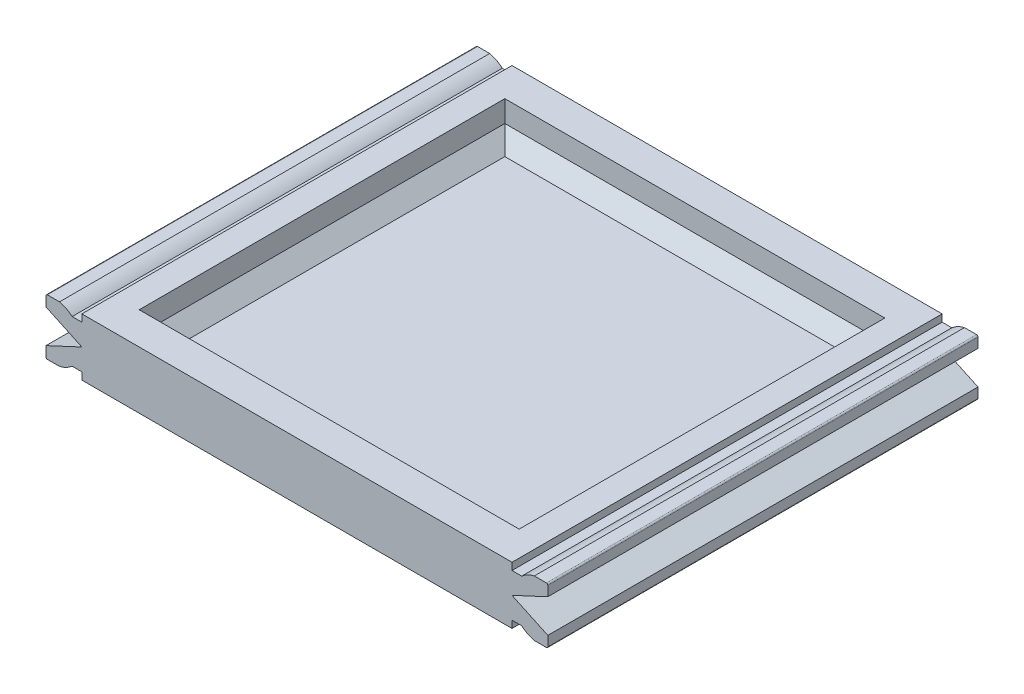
ISO-10303-21;
HEADER;
FILE_DESCRIPTION(('STEP AP214'),'2;1');
FILE_NAME('part.step','',(''),(''),'','','');
FILE_SCHEMA(('AUTOMOTIVE_DESIGN { 1 0 10303 214 1 1 1 1 }'));
ENDSEC;
DATA;
#1=APPLICATION_CONTEXT('core data for automotive mechanical design processes');
#2=APPLICATION_PROTOCOL_DEFINITION('international standard','automotive_design',2000,#1);
#3=PRODUCT_CONTEXT('',#1,'mechanical');
#4=PRODUCT('Part','Part','',(#3));
#5=PRODUCT_RELATED_PRODUCT_CATEGORY('part','',(#4));
#6=PRODUCT_DEFINITION_FORMATION('','',#4);
#7=PRODUCT_DEFINITION_CONTEXT('part definition',#1,'design');
#8=PRODUCT_DEFINITION('design','',#6,#7);
#9=PRODUCT_DEFINITION_SHAPE('','',#8);
#10=(LENGTH_UNIT() NAMED_UNIT(*) SI_UNIT(.MILLI.,.METRE.));
#11=(NAMED_UNIT(*) PLANE_ANGLE_UNIT() SI_UNIT($,.RADIAN.));
#12=(NAMED_UNIT(*) SI_UNIT($,.STERADIAN.) SOLID_ANGLE_UNIT());
#13=UNCERTAINTY_MEASURE_WITH_UNIT(LENGTH_MEASURE(1.E-05),#10,'distance_accuracy_value','');
#14=(GEOMETRIC_REPRESENTATION_CONTEXT(3) GLOBAL_UNCERTAINTY_ASSIGNED_CONTEXT((#13)) GLOBAL_UNIT_ASSIGNED_CONTEXT((#10,
#11,#12)) REPRESENTATION_CONTEXT('',''));
#15=CARTESIAN_POINT('',(0.,0.,0.));
#16=DIRECTION('',(0.,0.,1.));
#17=DIRECTION('',(1.,0.,0.));
#18=AXIS2_PLACEMENT_3D('',#15,#16,#17);
#19=CARTESIAN_POINT('',(-15.,-2.,-15.));
#20=DIRECTION('',(-1.,0.,0.));
#21=DIRECTION('',(0.,0.,1.));
#22=AXIS2_PLACEMENT_3D('',#19,#20,#21);
#23=PLANE('',#22);
#24=DIRECTION('',(0.,1.,0.));
#25=VECTOR('',#24,1.);
#26=CARTESIAN_POINT('',(-15.,-2.,15.));
#27=LINE('',#26,#25);
#28=CARTESIAN_POINT('',(-15.,-2.,15.));
#29=VERTEX_POINT('',#28);
#30=CARTESIAN_POINT('',(-15.,-1.5,15.));
#31=VERTEX_POINT('',#30);
#32=EDGE_CURVE('E518',#29,#31,#27,.T.);
#33=ORIENTED_EDGE('',*,*,#32,.T.);
#34=DIRECTION('',(0.,0.,1.));
#35=VECTOR('',#34,1.);
#36=CARTESIAN_POINT('',(-15.,-1.5,-15.));
#37=LINE('',#36,#35);
#38=CARTESIAN_POINT('',(-15.,-1.5,-15.));
#39=VERTEX_POINT('',#38);
#40=EDGE_CURVE('E314',#39,#31,#37,.T.);
#41=ORIENTED_EDGE('',*,*,#40,.F.);
#42=DIRECTION('',(0.,1.,0.));
#43=VECTOR('',#42,1.);
#44=CARTESIAN_POINT('',(-15.,-2.,-15.));
#45=LINE('',#44,#43);
#46=CARTESIAN_POINT('',(-15.,-2.,-15.));
#47=VERTEX_POINT('',#46);
#48=EDGE_CURVE('E537',#47,#39,#45,.T.);
#49=ORIENTED_EDGE('',*,*,#48,.F.);
#50=DIRECTION('',(0.,0.,1.));
#51=VECTOR('',#50,1.);
#52=CARTESIAN_POINT('',(-15.,-2.,-15.));
#53=LINE('',#52,#51);
#54=EDGE_CURVE('E549',#47,#29,#53,.T.);
#55=ORIENTED_EDGE('',*,*,#54,.T.);
#56=EDGE_LOOP('',(#33,#41,#49,#55));
#57=FACE_BOUND('',#56,.T.);
#58=ADVANCED_FACE('F36',(#57),#23,.T.);
#59=CARTESIAN_POINT('',(-15.,1.5,-15.));
#60=VERTEX_POINT('',#59);
#61=CARTESIAN_POINT('',(-15.,2.,-15.));
#62=VERTEX_POINT('',#61);
#63=EDGE_CURVE('E536',#60,#62,#45,.T.);
#64=ORIENTED_EDGE('',*,*,#63,.F.);
#65=DIRECTION('',(0.,0.,1.));
#66=VECTOR('',#65,1.);
#67=CARTESIAN_POINT('',(-15.,1.5,-15.));
#68=LINE('',#67,#66);
#69=CARTESIAN_POINT('',(-15.,1.5,15.));
#70=VERTEX_POINT('',#69);
#71=EDGE_CURVE('E342',#60,#70,#68,.T.);
#72=ORIENTED_EDGE('',*,*,#71,.T.);
#73=CARTESIAN_POINT('',(-15.,2.,15.));
#74=VERTEX_POINT('',#73);
#75=EDGE_CURVE('E523',#70,#74,#27,.T.);
#76=ORIENTED_EDGE('',*,*,#75,.T.);
#77=DIRECTION('',(0.,0.,1.));
#78=VECTOR('',#77,1.);
#79=CARTESIAN_POINT('',(-15.,2.,-15.));
#80=LINE('',#79,#78);
#81=EDGE_CURVE('E639',#62,#74,#80,.T.);
#82=ORIENTED_EDGE('',*,*,#81,.F.);
#83=EDGE_LOOP('',(#64,#72,#76,#82));
#84=FACE_BOUND('',#83,.T.);
#85=ADVANCED_FACE('F734',(#84),#23,.T.);
#86=CARTESIAN_POINT('',(15.,-2.,-15.));
#87=DIRECTION('',(1.,0.,0.));
#88=DIRECTION('',(0.,0.,-1.));
#89=AXIS2_PLACEMENT_3D('',#86,#87,#88);
#90=PLANE('',#89);
#91=DIRECTION('',(0.,0.,1.));
#92=VECTOR('',#91,1.);
#93=CARTESIAN_POINT('',(15.,-1.5,-15.));
#94=LINE('',#93,#92);
#95=CARTESIAN_POINT('',(15.,-1.5,-15.));
#96=VERTEX_POINT('',#95);
#97=CARTESIAN_POINT('',(15.,-1.5,15.));
#98=VERTEX_POINT('',#97);
#99=EDGE_CURVE('E466',#96,#98,#94,.T.);
#100=ORIENTED_EDGE('',*,*,#99,.T.);
#101=DIRECTION('',(0.,1.,0.));
#102=VECTOR('',#101,1.);
#103=CARTESIAN_POINT('',(15.,-2.,15.));
#104=LINE('',#103,#102);
#105=CARTESIAN_POINT('',(15.,-2.,15.));
#106=VERTEX_POINT('',#105);
#107=EDGE_CURVE('E666',#106,#98,#104,.T.);
#108=ORIENTED_EDGE('',*,*,#107,.F.);
#109=DIRECTION('',(0.,0.,-1.));
#110=VECTOR('',#109,1.);
#111=CARTESIAN_POINT('',(15.,-2.,-15.));
#112=LINE('',#111,#110);
#113=CARTESIAN_POINT('',(15.,-2.,-15.));
#114=VERTEX_POINT('',#113);
#115=EDGE_CURVE('E540',#106,#114,#112,.T.);
#116=ORIENTED_EDGE('',*,*,#115,.T.);
#117=DIRECTION('',(0.,1.,0.));
#118=VECTOR('',#117,1.);
#119=CARTESIAN_POINT('',(15.,-2.,-15.));
#120=LINE('',#119,#118);
#121=EDGE_CURVE('E558',#114,#96,#120,.T.);
#122=ORIENTED_EDGE('',*,*,#121,.T.);
#123=EDGE_LOOP('',(#100,#108,#116,#122));
#124=FACE_BOUND('',#123,.T.);
#125=ADVANCED_FACE('F659',(#124),#90,.T.);
#126=CARTESIAN_POINT('',(15.,-2.,-15.));
#127=DIRECTION('',(0.,0.,-1.));
#128=DIRECTION('',(-1.,0.,0.));
#129=AXIS2_PLACEMENT_3D('',#126,#127,#128);
#130=PLANE('',#129);
#131=DIRECTION('',(0.,-1.,0.));
#132=VECTOR('',#131,1.);
#133=CARTESIAN_POINT('',(17.5,0.,-15.));
#134=LINE('',#133,#132);
#135=CARTESIAN_POINT('',(17.5,-1.1657691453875,-15.));
#136=VERTEX_POINT('',#135);
#137=CARTESIAN_POINT('',(17.5,-1.85,-15.));
#138=VERTEX_POINT('',#137);
#139=EDGE_CURVE('E451',#136,#138,#134,.T.);
#140=ORIENTED_EDGE('',*,*,#139,.T.);
#141=CARTESIAN_POINT('',(17.4,-1.85,-15.));
#142=DIRECTION('',(0.,0.,-1.));
#143=DIRECTION('',(-1.,0.,0.));
#144=AXIS2_PLACEMENT_3D('',#141,#142,#143);
#145=CIRCLE('',#144,0.1);
#146=CARTESIAN_POINT('',(17.4,-1.95,-15.));
#147=VERTEX_POINT('',#146);
#148=EDGE_CURVE('E387',#138,#147,#145,.T.);
#149=ORIENTED_EDGE('',*,*,#148,.T.);
#150=DIRECTION('',(-1.,0.,0.));
#151=VECTOR('',#150,1.);
#152=CARTESIAN_POINT('',(0.,-1.94999999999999,-15.));
#153=LINE('',#152,#151);
#154=CARTESIAN_POINT('',(16.5555902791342,-1.95,-15.));
#155=VERTEX_POINT('',#154);
#156=EDGE_CURVE('E449',#147,#155,#153,.T.);
#157=ORIENTED_EDGE('',*,*,#156,.T.);
#158=CARTESIAN_POINT('',(17.,0.,-15.));
#159=DIRECTION('',(0.,0.,-1.));
#160=DIRECTION('',(1.,0.,0.));
#161=AXIS2_PLACEMENT_3D('',#158,#159,#160);
#162=CIRCLE('',#161,2.);
#163=CARTESIAN_POINT('',(15.6771243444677,-1.5,-15.));
#164=VERTEX_POINT('',#163);
#165=EDGE_CURVE('E457',#155,#164,#162,.T.);
#166=ORIENTED_EDGE('',*,*,#165,.T.);
#167=DIRECTION('',(1.,0.,0.));
#168=VECTOR('',#167,1.);
#169=CARTESIAN_POINT('',(0.,-1.50000000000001,-15.));
#170=LINE('',#169,#168);
#171=EDGE_CURVE('E454',#96,#164,#170,.T.);
#172=ORIENTED_EDGE('',*,*,#171,.F.);
#173=ORIENTED_EDGE('',*,*,#121,.F.);
#174=DIRECTION('',(-1.,0.,0.));
#175=VECTOR('',#174,1.);
#176=CARTESIAN_POINT('',(15.,-2.,-15.));
#177=LINE('',#176,#175);
#178=EDGE_CURVE('E648',#114,#47,#177,.T.);
#179=ORIENTED_EDGE('',*,*,#178,.T.);
#180=ORIENTED_EDGE('',*,*,#48,.T.);
#181=DIRECTION('',(-1.,0.,0.));
#182=VECTOR('',#181,1.);
#183=CARTESIAN_POINT('',(0.,-1.50000000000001,-15.));
#184=LINE('',#183,#182);
#185=CARTESIAN_POINT('',(-15.6771243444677,-1.5,-15.));
#186=VERTEX_POINT('',#185);
#187=EDGE_CURVE('E306',#39,#186,#184,.T.);
#188=ORIENTED_EDGE('',*,*,#187,.T.);
#189=CARTESIAN_POINT('',(-17.,0.,-15.));
#190=DIRECTION('',(0.,0.,1.));
#191=DIRECTION('',(-1.,0.,0.));
#192=AXIS2_PLACEMENT_3D('',#189,#190,#191);
#193=CIRCLE('',#192,2.);
#194=CARTESIAN_POINT('',(-16.5555902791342,-1.95,-15.));
#195=VERTEX_POINT('',#194);
#196=EDGE_CURVE('E304',#195,#186,#193,.T.);
#197=ORIENTED_EDGE('',*,*,#196,.F.);
#198=DIRECTION('',(1.,0.,0.));
#199=VECTOR('',#198,1.);
#200=CARTESIAN_POINT('',(0.,-1.94999999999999,-15.));
#201=LINE('',#200,#199);
#202=CARTESIAN_POINT('',(-17.4,-1.95,-15.));
#203=VERTEX_POINT('',#202);
#204=EDGE_CURVE('E287',#203,#195,#201,.T.);
#205=ORIENTED_EDGE('',*,*,#204,.F.);
#206=CARTESIAN_POINT('',(-17.4,-1.85,-15.));
#207=DIRECTION('',(0.,0.,-1.));
#208=DIRECTION('',(-1.,0.,0.));
#209=AXIS2_PLACEMENT_3D('',#206,#207,#208);
#210=CIRCLE('',#209,0.1);
#211=CARTESIAN_POINT('',(-17.5,-1.85,-15.));
#212=VERTEX_POINT('',#211);
#213=EDGE_CURVE('E384',#203,#212,#210,.T.);
#214=ORIENTED_EDGE('',*,*,#213,.T.);
#215=DIRECTION('',(0.,-1.,0.));
#216=VECTOR('',#215,1.);
#217=CARTESIAN_POINT('',(-17.5,0.,-15.));
#218=LINE('',#217,#216);
#219=CARTESIAN_POINT('',(-17.5,-1.1657691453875,-15.));
#220=VERTEX_POINT('',#219);
#221=EDGE_CURVE('E292',#220,#212,#218,.T.);
#222=ORIENTED_EDGE('',*,*,#221,.F.);
#223=DIRECTION('',(-0.906307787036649,-0.422618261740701,0.));
#224=VECTOR('',#223,1.);
#225=CARTESIAN_POINT('',(-2.67909292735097,5.74533332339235,-15.));
#226=LINE('',#225,#224);
#227=CARTESIAN_POINT('',(-15.,0.,-15.));
#228=VERTEX_POINT('',#227);
#229=EDGE_CURVE('E308',#228,#220,#226,.T.);
#230=ORIENTED_EDGE('',*,*,#229,.F.);
#231=DIRECTION('',(-0.906307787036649,0.422618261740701,0.));
#232=VECTOR('',#231,1.);
#233=CARTESIAN_POINT('',(-2.67909292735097,-5.74533332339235,-15.));
#234=LINE('',#233,#232);
#235=CARTESIAN_POINT('',(-17.5,1.1657691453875,-15.));
#236=VERTEX_POINT('',#235);
#237=EDGE_CURVE('E331',#228,#236,#234,.T.);
#238=ORIENTED_EDGE('',*,*,#237,.T.);
#239=DIRECTION('',(0.,1.,0.));
#240=VECTOR('',#239,1.);
#241=CARTESIAN_POINT('',(-17.5,0.,-15.));
#242=LINE('',#241,#240);
#243=CARTESIAN_POINT('',(-17.5,1.85,-15.));
#244=VERTEX_POINT('',#243);
#245=EDGE_CURVE('E328',#236,#244,#242,.T.);
#246=ORIENTED_EDGE('',*,*,#245,.T.);
#247=CARTESIAN_POINT('',(-17.4,1.85,-15.));
#248=DIRECTION('',(0.,0.,-1.));
#249=DIRECTION('',(-1.,0.,0.));
#250=AXIS2_PLACEMENT_3D('',#247,#248,#249);
#251=CIRCLE('',#250,0.1);
#252=CARTESIAN_POINT('',(-17.4,1.95,-15.));
#253=VERTEX_POINT('',#252);
#254=EDGE_CURVE('E382',#244,#253,#251,.T.);
#255=ORIENTED_EDGE('',*,*,#254,.T.);
#256=DIRECTION('',(1.,0.,0.));
#257=VECTOR('',#256,1.);
#258=CARTESIAN_POINT('',(0.,1.94999999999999,-15.));
#259=LINE('',#258,#257);
#260=CARTESIAN_POINT('',(-16.5555902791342,1.95,-15.));
#261=VERTEX_POINT('',#260);
#262=EDGE_CURVE('E325',#253,#261,#259,.T.);
#263=ORIENTED_EDGE('',*,*,#262,.T.);
#264=CARTESIAN_POINT('',(-17.,0.,-15.));
#265=DIRECTION('',(0.,0.,-1.));
#266=DIRECTION('',(-1.,0.,0.));
#267=AXIS2_PLACEMENT_3D('',#264,#265,#266);
#268=CIRCLE('',#267,2.);
#269=CARTESIAN_POINT('',(-15.6771243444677,1.5,-15.));
#270=VERTEX_POINT('',#269);
#271=EDGE_CURVE('E332',#261,#270,#268,.T.);
#272=ORIENTED_EDGE('',*,*,#271,.T.);
#273=DIRECTION('',(-1.,0.,0.));
#274=VECTOR('',#273,1.);
#275=CARTESIAN_POINT('',(0.,1.50000000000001,-15.));
#276=LINE('',#275,#274);
#277=EDGE_CURVE('E335',#60,#270,#276,.T.);
#278=ORIENTED_EDGE('',*,*,#277,.F.);
#279=ORIENTED_EDGE('',*,*,#63,.T.);
#280=DIRECTION('',(-1.,0.,0.));
#281=VECTOR('',#280,1.);
#282=CARTESIAN_POINT('',(15.,2.,-15.));
#283=LINE('',#282,#281);
#284=CARTESIAN_POINT('',(15.,2.,-15.));
#285=VERTEX_POINT('',#284);
#286=EDGE_CURVE('E613',#285,#62,#283,.T.);
#287=ORIENTED_EDGE('',*,*,#286,.F.);
#288=CARTESIAN_POINT('',(15.,1.5,-15.));
#289=VERTEX_POINT('',#288);
#290=EDGE_CURVE('E555',#289,#285,#120,.T.);
#291=ORIENTED_EDGE('',*,*,#290,.F.);
#292=DIRECTION('',(1.,0.,0.));
#293=VECTOR('',#292,1.);
#294=CARTESIAN_POINT('',(0.,1.50000000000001,-15.));
#295=LINE('',#294,#293);
#296=CARTESIAN_POINT('',(15.6771243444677,1.5,-15.));
#297=VERTEX_POINT('',#296);
#298=EDGE_CURVE('E483',#289,#297,#295,.T.);
#299=ORIENTED_EDGE('',*,*,#298,.T.);
#300=CARTESIAN_POINT('',(17.,0.,-15.));
#301=DIRECTION('',(0.,0.,1.));
#302=DIRECTION('',(1.,0.,0.));
#303=AXIS2_PLACEMENT_3D('',#300,#301,#302);
#304=CIRCLE('',#303,2.);
#305=CARTESIAN_POINT('',(16.5555902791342,1.95,-15.));
#306=VERTEX_POINT('',#305);
#307=EDGE_CURVE('E480',#306,#297,#304,.T.);
#308=ORIENTED_EDGE('',*,*,#307,.F.);
#309=DIRECTION('',(-1.,0.,0.));
#310=VECTOR('',#309,1.);
#311=CARTESIAN_POINT('',(0.,1.94999999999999,-15.));
#312=LINE('',#311,#310);
#313=CARTESIAN_POINT('',(17.4,1.95,-15.));
#314=VERTEX_POINT('',#313);
#315=EDGE_CURVE('E477',#314,#306,#312,.T.);
#316=ORIENTED_EDGE('',*,*,#315,.F.);
#317=CARTESIAN_POINT('',(17.4,1.85,-15.));
#318=DIRECTION('',(0.,0.,-1.));
#319=DIRECTION('',(-1.,0.,0.));
#320=AXIS2_PLACEMENT_3D('',#317,#318,#319);
#321=CIRCLE('',#320,0.1);
#322=CARTESIAN_POINT('',(17.5,1.85,-15.));
#323=VERTEX_POINT('',#322);
#324=EDGE_CURVE('E51',#314,#323,#321,.T.);
#325=ORIENTED_EDGE('',*,*,#324,.T.);
#326=DIRECTION('',(0.,1.,0.));
#327=VECTOR('',#326,1.);
#328=CARTESIAN_POINT('',(17.5,0.,-15.));
#329=LINE('',#328,#327);
#330=CARTESIAN_POINT('',(17.5,1.1657691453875,-15.));
#331=VERTEX_POINT('',#330);
#332=EDGE_CURVE('E484',#331,#323,#329,.T.);
#333=ORIENTED_EDGE('',*,*,#332,.F.);
#334=DIRECTION('',(0.906307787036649,0.422618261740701,0.));
#335=VECTOR('',#334,1.);
#336=CARTESIAN_POINT('',(2.67909292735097,-5.74533332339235,-15.));
#337=LINE('',#336,#335);
#338=CARTESIAN_POINT('',(15.,0.,-15.));
#339=VERTEX_POINT('',#338);
#340=EDGE_CURVE('E487',#339,#331,#337,.T.);
#341=ORIENTED_EDGE('',*,*,#340,.F.);
#342=DIRECTION('',(0.906307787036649,-0.422618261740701,0.));
#343=VECTOR('',#342,1.);
#344=CARTESIAN_POINT('',(2.67909292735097,5.74533332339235,-15.));
#345=LINE('',#344,#343);
#346=EDGE_CURVE('E453',#339,#136,#345,.T.);
#347=ORIENTED_EDGE('',*,*,#346,.T.);
#348=EDGE_LOOP('',(#140,#149,#157,#166,#172,#173,#179,#180,#188,#197,#205,#214,#222,#230,#238,
#246,#255,#263,#272,#278,#279,#287,#291,#299,#308,#316,#325,#333,#341,#347));
#349=FACE_BOUND('',#348,.T.);
#350=ADVANCED_FACE('F416',(#349),#130,.T.);
#351=DIRECTION('',(0.,0.,1.));
#352=VECTOR('',#351,1.);
#353=CARTESIAN_POINT('',(15.,1.5,-15.));
#354=LINE('',#353,#352);
#355=CARTESIAN_POINT('',(15.,1.5,15.));
#356=VERTEX_POINT('',#355);
#357=EDGE_CURVE('E500',#289,#356,#354,.T.);
#358=ORIENTED_EDGE('',*,*,#357,.F.);
#359=ORIENTED_EDGE('',*,*,#290,.T.);
#360=DIRECTION('',(0.,0.,-1.));
#361=VECTOR('',#360,1.);
#362=CARTESIAN_POINT('',(15.,2.,-15.));
#363=LINE('',#362,#361);
#364=CARTESIAN_POINT('',(15.,2.,15.));
#365=VERTEX_POINT('',#364);
#366=EDGE_CURVE('E645',#365,#285,#363,.T.);
#367=ORIENTED_EDGE('',*,*,#366,.F.);
#368=EDGE_CURVE('E522',#356,#365,#104,.T.);
#369=ORIENTED_EDGE('',*,*,#368,.F.);
#370=EDGE_LOOP('',(#358,#359,#367,#369));
#371=FACE_BOUND('',#370,.T.);
#372=ADVANCED_FACE('F723',(#371),#90,.T.);
#373=CARTESIAN_POINT('',(15.,-2.,15.));
#374=DIRECTION('',(0.,0.,1.));
#375=DIRECTION('',(1.,0.,0.));
#376=AXIS2_PLACEMENT_3D('',#373,#374,#375);
#377=PLANE('',#376);
#378=DIRECTION('',(-1.,0.,0.));
#379=VECTOR('',#378,1.);
#380=CARTESIAN_POINT('',(0.,-1.94999999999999,15.));
#381=LINE('',#380,#379);
#382=CARTESIAN_POINT('',(17.4,-1.95,15.));
#383=VERTEX_POINT('',#382);
#384=CARTESIAN_POINT('',(16.5555902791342,-1.95,15.));
#385=VERTEX_POINT('',#384);
#386=EDGE_CURVE('E339',#383,#385,#381,.T.);
#387=ORIENTED_EDGE('',*,*,#386,.F.);
#388=CARTESIAN_POINT('',(17.4,-1.85,15.));
#389=DIRECTION('',(0.,0.,1.));
#390=DIRECTION('',(1.,0.,0.));
#391=AXIS2_PLACEMENT_3D('',#388,#389,#390);
#392=CIRCLE('',#391,0.1);
#393=CARTESIAN_POINT('',(17.5,-1.85,15.));
#394=VERTEX_POINT('',#393);
#395=EDGE_CURVE('E378',#383,#394,#392,.T.);
#396=ORIENTED_EDGE('',*,*,#395,.T.);
#397=DIRECTION('',(0.,-1.,0.));
#398=VECTOR('',#397,1.);
#399=CARTESIAN_POINT('',(17.5,0.,15.));
#400=LINE('',#399,#398);
#401=CARTESIAN_POINT('',(17.5,-1.1657691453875,15.));
#402=VERTEX_POINT('',#401);
#403=EDGE_CURVE('E439',#402,#394,#400,.T.);
#404=ORIENTED_EDGE('',*,*,#403,.F.);
#405=DIRECTION('',(0.906307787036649,-0.422618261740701,0.));
#406=VECTOR('',#405,1.);
#407=CARTESIAN_POINT('',(2.67909292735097,5.74533332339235,15.));
#408=LINE('',#407,#406);
#409=CARTESIAN_POINT('',(15.,0.,15.));
#410=VERTEX_POINT('',#409);
#411=EDGE_CURVE('E442',#410,#402,#408,.T.);
#412=ORIENTED_EDGE('',*,*,#411,.F.);
#413=DIRECTION('',(0.906307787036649,0.422618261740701,0.));
#414=VECTOR('',#413,1.);
#415=CARTESIAN_POINT('',(2.67909292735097,-5.74533332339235,15.));
#416=LINE('',#415,#414);
#417=CARTESIAN_POINT('',(17.5,1.1657691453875,15.));
#418=VERTEX_POINT('',#417);
#419=EDGE_CURVE('E478',#410,#418,#416,.T.);
#420=ORIENTED_EDGE('',*,*,#419,.T.);
#421=DIRECTION('',(0.,1.,0.));
#422=VECTOR('',#421,1.);
#423=CARTESIAN_POINT('',(17.5,0.,15.));
#424=LINE('',#423,#422);
#425=CARTESIAN_POINT('',(17.5,1.85,15.));
#426=VERTEX_POINT('',#425);
#427=EDGE_CURVE('E474',#418,#426,#424,.T.);
#428=ORIENTED_EDGE('',*,*,#427,.T.);
#429=CARTESIAN_POINT('',(17.4,1.85,15.));
#430=DIRECTION('',(0.,0.,1.));
#431=DIRECTION('',(1.,0.,0.));
#432=AXIS2_PLACEMENT_3D('',#429,#430,#431);
#433=CIRCLE('',#432,0.1);
#434=CARTESIAN_POINT('',(17.4,1.95,15.));
#435=VERTEX_POINT('',#434);
#436=EDGE_CURVE('E376',#426,#435,#433,.T.);
#437=ORIENTED_EDGE('',*,*,#436,.T.);
#438=DIRECTION('',(-1.,0.,0.));
#439=VECTOR('',#438,1.);
#440=CARTESIAN_POINT('',(0.,1.94999999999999,15.));
#441=LINE('',#440,#439);
#442=CARTESIAN_POINT('',(16.5555902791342,1.95,15.));
#443=VERTEX_POINT('',#442);
#444=EDGE_CURVE('E463',#435,#443,#441,.T.);
#445=ORIENTED_EDGE('',*,*,#444,.T.);
#446=CARTESIAN_POINT('',(17.,0.,15.));
#447=DIRECTION('',(0.,0.,1.));
#448=DIRECTION('',(1.,0.,0.));
#449=AXIS2_PLACEMENT_3D('',#446,#447,#448);
#450=CIRCLE('',#449,2.);
#451=CARTESIAN_POINT('',(15.6771243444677,1.5,15.));
#452=VERTEX_POINT('',#451);
#453=EDGE_CURVE('E470',#443,#452,#450,.T.);
#454=ORIENTED_EDGE('',*,*,#453,.T.);
#455=DIRECTION('',(1.,0.,0.));
#456=VECTOR('',#455,1.);
#457=CARTESIAN_POINT('',(0.,1.50000000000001,15.));
#458=LINE('',#457,#456);
#459=EDGE_CURVE('E473',#356,#452,#458,.T.);
#460=ORIENTED_EDGE('',*,*,#459,.F.);
#461=ORIENTED_EDGE('',*,*,#368,.T.);
#462=DIRECTION('',(1.,0.,0.));
#463=VECTOR('',#462,1.);
#464=CARTESIAN_POINT('',(15.,2.,15.));
#465=LINE('',#464,#463);
#466=EDGE_CURVE('E642',#74,#365,#465,.T.);
#467=ORIENTED_EDGE('',*,*,#466,.F.);
#468=ORIENTED_EDGE('',*,*,#75,.F.);
#469=DIRECTION('',(-1.,0.,0.));
#470=VECTOR('',#469,1.);
#471=CARTESIAN_POINT('',(0.,1.50000000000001,15.));
#472=LINE('',#471,#470);
#473=CARTESIAN_POINT('',(-15.6771243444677,1.5,15.));
#474=VERTEX_POINT('',#473);
#475=EDGE_CURVE('E326',#70,#474,#472,.T.);
#476=ORIENTED_EDGE('',*,*,#475,.T.);
#477=CARTESIAN_POINT('',(-17.,0.,15.));
#478=DIRECTION('',(0.,0.,-1.));
#479=DIRECTION('',(-1.,0.,0.));
#480=AXIS2_PLACEMENT_3D('',#477,#478,#479);
#481=CIRCLE('',#480,2.);
#482=CARTESIAN_POINT('',(-16.5555902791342,1.95,15.));
#483=VERTEX_POINT('',#482);
#484=EDGE_CURVE('E322',#483,#474,#481,.T.);
#485=ORIENTED_EDGE('',*,*,#484,.F.);
#486=DIRECTION('',(1.,0.,0.));
#487=VECTOR('',#486,1.);
#488=CARTESIAN_POINT('',(0.,1.94999999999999,15.));
#489=LINE('',#488,#487);
#490=CARTESIAN_POINT('',(-17.4,1.95,15.));
#491=VERTEX_POINT('',#490);
#492=EDGE_CURVE('E313',#491,#483,#489,.T.);
#493=ORIENTED_EDGE('',*,*,#492,.F.);
#494=CARTESIAN_POINT('',(-17.4,1.85,15.));
#495=DIRECTION('',(0.,0.,1.));
#496=DIRECTION('',(1.,0.,0.));
#497=AXIS2_PLACEMENT_3D('',#494,#495,#496);
#498=CIRCLE('',#497,0.1);
#499=CARTESIAN_POINT('',(-17.5,1.85,15.));
#500=VERTEX_POINT('',#499);
#501=EDGE_CURVE('E372',#491,#500,#498,.T.);
#502=ORIENTED_EDGE('',*,*,#501,.T.);
#503=DIRECTION('',(0.,1.,0.));
#504=VECTOR('',#503,1.);
#505=CARTESIAN_POINT('',(-17.5,0.,15.));
#506=LINE('',#505,#504);
#507=CARTESIAN_POINT('',(-17.5,1.1657691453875,15.));
#508=VERTEX_POINT('',#507);
#509=EDGE_CURVE('E318',#508,#500,#506,.T.);
#510=ORIENTED_EDGE('',*,*,#509,.F.);
#511=DIRECTION('',(-0.906307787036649,0.422618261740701,0.));
#512=VECTOR('',#511,1.);
#513=CARTESIAN_POINT('',(-2.67909292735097,-5.74533332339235,15.));
#514=LINE('',#513,#512);
#515=CARTESIAN_POINT('',(-15.,0.,15.));
#516=VERTEX_POINT('',#515);
#517=EDGE_CURVE('E321',#516,#508,#514,.T.);
#518=ORIENTED_EDGE('',*,*,#517,.F.);
#519=DIRECTION('',(-0.906307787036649,-0.422618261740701,0.));
#520=VECTOR('',#519,1.);
#521=CARTESIAN_POINT('',(-2.67909292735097,5.74533332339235,15.));
#522=LINE('',#521,#520);
#523=CARTESIAN_POINT('',(-17.5,-1.1657691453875,15.));
#524=VERTEX_POINT('',#523);
#525=EDGE_CURVE('E298',#516,#524,#522,.T.);
#526=ORIENTED_EDGE('',*,*,#525,.T.);
#527=DIRECTION('',(0.,-1.,0.));
#528=VECTOR('',#527,1.);
#529=CARTESIAN_POINT('',(-17.5,0.,15.));
#530=LINE('',#529,#528);
#531=CARTESIAN_POINT('',(-17.5,-1.85,15.));
#532=VERTEX_POINT('',#531);
#533=EDGE_CURVE('E301',#524,#532,#530,.T.);
#534=ORIENTED_EDGE('',*,*,#533,.T.);
#535=CARTESIAN_POINT('',(-17.4,-1.85,15.));
#536=DIRECTION('',(0.,0.,1.));
#537=DIRECTION('',(1.,0.,0.));
#538=AXIS2_PLACEMENT_3D('',#535,#536,#537);
#539=CIRCLE('',#538,0.1);
#540=CARTESIAN_POINT('',(-17.4,-1.95,15.));
#541=VERTEX_POINT('',#540);
#542=EDGE_CURVE('E279',#532,#541,#539,.T.);
#543=ORIENTED_EDGE('',*,*,#542,.T.);
#544=DIRECTION('',(1.,0.,0.));
#545=VECTOR('',#544,1.);
#546=CARTESIAN_POINT('',(0.,-1.94999999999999,15.));
#547=LINE('',#546,#545);
#548=CARTESIAN_POINT('',(-16.5555902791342,-1.95,15.));
#549=VERTEX_POINT('',#548);
#550=EDGE_CURVE('E270',#541,#549,#547,.T.);
#551=ORIENTED_EDGE('',*,*,#550,.T.);
#552=CARTESIAN_POINT('',(-17.,0.,15.));
#553=DIRECTION('',(0.,0.,1.));
#554=DIRECTION('',(-1.,0.,0.));
#555=AXIS2_PLACEMENT_3D('',#552,#553,#554);
#556=CIRCLE('',#555,2.);
#557=CARTESIAN_POINT('',(-15.6771243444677,-1.5,15.));
#558=VERTEX_POINT('',#557);
#559=EDGE_CURVE('E276',#549,#558,#556,.T.);
#560=ORIENTED_EDGE('',*,*,#559,.T.);
#561=DIRECTION('',(-1.,0.,0.));
#562=VECTOR('',#561,1.);
#563=CARTESIAN_POINT('',(0.,-1.50000000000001,15.));
#564=LINE('',#563,#562);
#565=EDGE_CURVE('E296',#31,#558,#564,.T.);
#566=ORIENTED_EDGE('',*,*,#565,.F.);
#567=ORIENTED_EDGE('',*,*,#32,.F.);
#568=DIRECTION('',(1.,0.,0.));
#569=VECTOR('',#568,1.);
#570=CARTESIAN_POINT('',(15.,-2.,15.));
#571=LINE('',#570,#569);
#572=EDGE_CURVE('E544',#29,#106,#571,.T.);
#573=ORIENTED_EDGE('',*,*,#572,.T.);
#574=ORIENTED_EDGE('',*,*,#107,.T.);
#575=DIRECTION('',(1.,0.,0.));
#576=VECTOR('',#575,1.);
#577=CARTESIAN_POINT('',(0.,-1.50000000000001,15.));
#578=LINE('',#577,#576);
#579=CARTESIAN_POINT('',(15.6771243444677,-1.5,15.));
#580=VERTEX_POINT('',#579);
#581=EDGE_CURVE('E443',#98,#580,#578,.T.);
#582=ORIENTED_EDGE('',*,*,#581,.T.);
#583=CARTESIAN_POINT('',(17.,0.,15.));
#584=DIRECTION('',(0.,0.,-1.));
#585=DIRECTION('',(1.,0.,0.));
#586=AXIS2_PLACEMENT_3D('',#583,#584,#585);
#587=CIRCLE('',#586,2.);
#588=EDGE_CURVE('E446',#385,#580,#587,.T.);
#589=ORIENTED_EDGE('',*,*,#588,.F.);
#590=EDGE_LOOP('',(#387,#396,#404,#412,#420,#428,#437,#445,#454,#460,#461,#467,#468,#476,#485,
#493,#502,#510,#518,#526,#534,#543,#551,#560,#566,#567,#573,#574,#582,#589));
#591=FACE_BOUND('',#590,.T.);
#592=ADVANCED_FACE('F273',(#591),#377,.T.);
#593=CARTESIAN_POINT('',(0.,-2.,0.));
#594=DIRECTION('',(0.,1.,0.));
#595=DIRECTION('',(0.,0.,1.));
#596=AXIS2_PLACEMENT_3D('',#593,#594,#595);
#597=PLANE('',#596);
#598=ORIENTED_EDGE('',*,*,#178,.F.);
#599=ORIENTED_EDGE('',*,*,#115,.F.);
#600=ORIENTED_EDGE('',*,*,#572,.F.);
#601=ORIENTED_EDGE('',*,*,#54,.F.);
#602=EDGE_LOOP('',(#598,#599,#600,#601));
#603=FACE_BOUND('',#602,.T.);
#604=ADVANCED_FACE('F656',(#603),#597,.F.);
#605=CARTESIAN_POINT('',(0.,2.,0.));
#606=DIRECTION('',(0.,1.,0.));
#607=DIRECTION('',(0.,0.,1.));
#608=AXIS2_PLACEMENT_3D('',#605,#606,#607);
#609=PLANE('',#608);
#610=DIRECTION('',(-1.,0.,0.));
#611=VECTOR('',#610,1.);
#612=CARTESIAN_POINT('',(13.25,2.,-12.75));
#613=LINE('',#612,#611);
#614=CARTESIAN_POINT('',(13.25,2.,-12.75));
#615=VERTEX_POINT('',#614);
#616=CARTESIAN_POINT('',(-13.25,2.,-12.75));
#617=VERTEX_POINT('',#616);
#618=EDGE_CURVE('E563',#615,#617,#613,.T.);
#619=ORIENTED_EDGE('',*,*,#618,.F.);
#620=DIRECTION('',(0.,0.,-1.));
#621=VECTOR('',#620,1.);
#622=CARTESIAN_POINT('',(13.25,2.,-12.75));
#623=LINE('',#622,#621);
#624=CARTESIAN_POINT('',(13.25,2.,12.75));
#625=VERTEX_POINT('',#624);
#626=EDGE_CURVE('E611',#625,#615,#623,.T.);
#627=ORIENTED_EDGE('',*,*,#626,.F.);
#628=DIRECTION('',(1.,0.,0.));
#629=VECTOR('',#628,1.);
#630=CARTESIAN_POINT('',(13.25,2.,12.75));
#631=LINE('',#630,#629);
#632=CARTESIAN_POINT('',(-13.25,2.,12.75));
#633=VERTEX_POINT('',#632);
#634=EDGE_CURVE('E1088',#633,#625,#631,.T.);
#635=ORIENTED_EDGE('',*,*,#634,.F.);
#636=DIRECTION('',(0.,0.,1.));
#637=VECTOR('',#636,1.);
#638=CARTESIAN_POINT('',(-13.25,2.,-12.75));
#639=LINE('',#638,#637);
#640=EDGE_CURVE('E631',#617,#633,#639,.T.);
#641=ORIENTED_EDGE('',*,*,#640,.F.);
#642=EDGE_LOOP('',(#619,#627,#635,#641));
#643=FACE_BOUND('',#642,.T.);
#644=ORIENTED_EDGE('',*,*,#286,.T.);
#645=ORIENTED_EDGE('',*,*,#81,.T.);
#646=ORIENTED_EDGE('',*,*,#466,.T.);
#647=ORIENTED_EDGE('',*,*,#366,.T.);
#648=EDGE_LOOP('',(#644,#645,#646,#647));
#649=FACE_BOUND('',#648,.T.);
#650=ADVANCED_FACE('F722',(#643,#649),#609,.T.);
#651=CARTESIAN_POINT('',(13.25,-0.5,-12.75));
#652=DIRECTION('',(0.,0.,-1.));
#653=DIRECTION('',(-1.,0.,0.));
#654=AXIS2_PLACEMENT_3D('',#651,#652,#653);
#655=PLANE('',#654);
#656=DIRECTION('',(0.,1.,0.));
#657=VECTOR('',#656,1.);
#658=CARTESIAN_POINT('',(-13.25,-0.5,-12.75));
#659=LINE('',#658,#657);
#660=CARTESIAN_POINT('',(-13.25,0.500000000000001,-12.75));
#661=VERTEX_POINT('',#660);
#662=EDGE_CURVE('E605',#661,#617,#659,.T.);
#663=ORIENTED_EDGE('',*,*,#662,.F.);
#664=DIRECTION('',(1.,0.,0.));
#665=VECTOR('',#664,1.);
#666=CARTESIAN_POINT('',(13.25,0.500000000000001,-12.75));
#667=LINE('',#666,#665);
#668=CARTESIAN_POINT('',(13.25,0.500000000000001,-12.75));
#669=VERTEX_POINT('',#668);
#670=EDGE_CURVE('E373',#661,#669,#667,.T.);
#671=ORIENTED_EDGE('',*,*,#670,.T.);
#672=DIRECTION('',(0.,1.,0.));
#673=VECTOR('',#672,1.);
#674=CARTESIAN_POINT('',(13.25,-0.5,-12.75));
#675=LINE('',#674,#673);
#676=EDGE_CURVE('E603',#669,#615,#675,.T.);
#677=ORIENTED_EDGE('',*,*,#676,.T.);
#678=ORIENTED_EDGE('',*,*,#618,.T.);
#679=EDGE_LOOP('',(#663,#671,#677,#678));
#680=FACE_BOUND('',#679,.T.);
#681=ADVANCED_FACE('F601',(#680),#655,.F.);
#682=CARTESIAN_POINT('',(13.25,-0.5,-12.75));
#683=DIRECTION('',(1.,0.,0.));
#684=DIRECTION('',(0.,0.,-1.));
#685=AXIS2_PLACEMENT_3D('',#682,#683,#684);
#686=PLANE('',#685);
#687=ORIENTED_EDGE('',*,*,#676,.F.);
#688=DIRECTION('',(0.,0.,1.));
#689=VECTOR('',#688,1.);
#690=CARTESIAN_POINT('',(13.25,0.500000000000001,-12.75));
#691=LINE('',#690,#689);
#692=CARTESIAN_POINT('',(13.25,0.500000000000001,12.75));
#693=VERTEX_POINT('',#692);
#694=EDGE_CURVE('E575',#669,#693,#691,.T.);
#695=ORIENTED_EDGE('',*,*,#694,.T.);
#696=DIRECTION('',(0.,1.,0.));
#697=VECTOR('',#696,1.);
#698=CARTESIAN_POINT('',(13.25,-0.5,12.75));
#699=LINE('',#698,#697);
#700=EDGE_CURVE('E614',#693,#625,#699,.T.);
#701=ORIENTED_EDGE('',*,*,#700,.T.);
#702=ORIENTED_EDGE('',*,*,#626,.T.);
#703=EDGE_LOOP('',(#687,#695,#701,#702));
#704=FACE_BOUND('',#703,.T.);
#705=ADVANCED_FACE('F608',(#704),#686,.F.);
#706=CARTESIAN_POINT('',(13.25,-0.5,12.75));
#707=DIRECTION('',(0.,0.,1.));
#708=DIRECTION('',(1.,0.,0.));
#709=AXIS2_PLACEMENT_3D('',#706,#707,#708);
#710=PLANE('',#709);
#711=ORIENTED_EDGE('',*,*,#700,.F.);
#712=DIRECTION('',(-1.,0.,0.));
#713=VECTOR('',#712,1.);
#714=CARTESIAN_POINT('',(13.25,0.500000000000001,12.75));
#715=LINE('',#714,#713);
#716=CARTESIAN_POINT('',(-13.25,0.500000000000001,12.75));
#717=VERTEX_POINT('',#716);
#718=EDGE_CURVE('E573',#693,#717,#715,.T.);
#719=ORIENTED_EDGE('',*,*,#718,.T.);
#720=DIRECTION('',(0.,1.,0.));
#721=VECTOR('',#720,1.);
#722=CARTESIAN_POINT('',(-13.25,-0.5,12.75));
#723=LINE('',#722,#721);
#724=EDGE_CURVE('E626',#717,#633,#723,.T.);
#725=ORIENTED_EDGE('',*,*,#724,.T.);
#726=ORIENTED_EDGE('',*,*,#634,.T.);
#727=EDGE_LOOP('',(#711,#719,#725,#726));
#728=FACE_BOUND('',#727,.T.);
#729=ADVANCED_FACE('F624',(#728),#710,.F.);
#730=CARTESIAN_POINT('',(-13.25,-0.5,-12.75));
#731=DIRECTION('',(-1.,0.,0.));
#732=DIRECTION('',(0.,0.,1.));
#733=AXIS2_PLACEMENT_3D('',#730,#731,#732);
#734=PLANE('',#733);
#735=ORIENTED_EDGE('',*,*,#724,.F.);
#736=DIRECTION('',(0.,0.,-1.));
#737=VECTOR('',#736,1.);
#738=CARTESIAN_POINT('',(-13.25,0.500000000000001,-12.75));
#739=LINE('',#738,#737);
#740=EDGE_CURVE('E571',#717,#661,#739,.T.);
#741=ORIENTED_EDGE('',*,*,#740,.T.);
#742=ORIENTED_EDGE('',*,*,#662,.T.);
#743=ORIENTED_EDGE('',*,*,#640,.T.);
#744=EDGE_LOOP('',(#735,#741,#742,#743));
#745=FACE_BOUND('',#744,.T.);
#746=ADVANCED_FACE('F629',(#745),#734,.F.);
#747=CARTESIAN_POINT('',(0.,-0.5,0.));
#748=DIRECTION('',(0.,1.,0.));
#749=DIRECTION('',(0.,0.,1.));
#750=AXIS2_PLACEMENT_3D('',#747,#748,#749);
#751=PLANE('',#750);
#752=DIRECTION('',(1.,0.,0.));
#753=VECTOR('',#752,1.);
#754=CARTESIAN_POINT('',(0.,-0.5,11.75));
#755=LINE('',#754,#753);
#756=CARTESIAN_POINT('',(-12.25,-0.5,11.75));
#757=VERTEX_POINT('',#756);
#758=CARTESIAN_POINT('',(12.25,-0.5,11.75));
#759=VERTEX_POINT('',#758);
#760=EDGE_CURVE('E581',#757,#759,#755,.T.);
#761=ORIENTED_EDGE('',*,*,#760,.T.);
#762=DIRECTION('',(0.,0.,-1.));
#763=VECTOR('',#762,1.);
#764=CARTESIAN_POINT('',(12.25,-0.5,0.));
#765=LINE('',#764,#763);
#766=CARTESIAN_POINT('',(12.25,-0.5,-11.75));
#767=VERTEX_POINT('',#766);
#768=EDGE_CURVE('E578',#759,#767,#765,.T.);
#769=ORIENTED_EDGE('',*,*,#768,.T.);
#770=DIRECTION('',(-1.,0.,0.));
#771=VECTOR('',#770,1.);
#772=CARTESIAN_POINT('',(0.,-0.5,-11.75));
#773=LINE('',#772,#771);
#774=CARTESIAN_POINT('',(-12.25,-0.5,-11.75));
#775=VERTEX_POINT('',#774);
#776=EDGE_CURVE('E533',#767,#775,#773,.T.);
#777=ORIENTED_EDGE('',*,*,#776,.T.);
#778=DIRECTION('',(0.,0.,1.));
#779=VECTOR('',#778,1.);
#780=CARTESIAN_POINT('',(-12.25,-0.5,0.));
#781=LINE('',#780,#779);
#782=EDGE_CURVE('E582',#775,#757,#781,.T.);
#783=ORIENTED_EDGE('',*,*,#782,.T.);
#784=EDGE_LOOP('',(#761,#769,#777,#783));
#785=FACE_BOUND('',#784,.T.);
#786=ADVANCED_FACE('F587',(#785),#751,.T.);
#787=CARTESIAN_POINT('',(-12.25,-0.5,0.));
#788=DIRECTION('',(-0.707106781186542,-0.707106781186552,0.));
#789=DIRECTION('',(0.,0.,1.));
#790=AXIS2_PLACEMENT_3D('',#787,#788,#789);
#791=PLANE('',#790);
#792=DIRECTION('',(0.577350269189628,-0.57735026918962,0.577350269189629));
#793=VECTOR('',#792,1.);
#794=CARTESIAN_POINT('',(-8.33333333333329,-4.41666666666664,-7.83333333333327));
#795=LINE('',#794,#793);
#796=EDGE_CURVE('E564',#661,#775,#795,.T.);
#797=ORIENTED_EDGE('',*,*,#796,.F.);
#798=ORIENTED_EDGE('',*,*,#740,.F.);
#799=DIRECTION('',(0.577350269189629,-0.577350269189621,-0.577350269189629));
#800=VECTOR('',#799,1.);
#801=CARTESIAN_POINT('',(-8.16666666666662,-4.58333333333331,7.66666666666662));
#802=LINE('',#801,#800);
#803=EDGE_CURVE('E560',#757,#717,#802,.F.);
#804=ORIENTED_EDGE('',*,*,#803,.F.);
#805=ORIENTED_EDGE('',*,*,#782,.F.);
#806=EDGE_LOOP('',(#797,#798,#804,#805));
#807=FACE_BOUND('',#806,.T.);
#808=ADVANCED_FACE('F593',(#807),#791,.F.);
#809=CARTESIAN_POINT('',(0.,-0.5,11.75));
#810=DIRECTION('',(0.,-0.707106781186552,0.707106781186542));
#811=DIRECTION('',(1.,0.,0.));
#812=AXIS2_PLACEMENT_3D('',#809,#810,#811);
#813=PLANE('',#812);
#814=ORIENTED_EDGE('',*,*,#803,.T.);
#815=ORIENTED_EDGE('',*,*,#718,.F.);
#816=DIRECTION('',(-0.577350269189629,-0.577350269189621,-0.577350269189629));
#817=VECTOR('',#816,1.);
#818=CARTESIAN_POINT('',(8.33333333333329,-4.41666666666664,7.83333333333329));
#819=LINE('',#818,#817);
#820=EDGE_CURVE('E567',#759,#693,#819,.F.);
#821=ORIENTED_EDGE('',*,*,#820,.F.);
#822=ORIENTED_EDGE('',*,*,#760,.F.);
#823=EDGE_LOOP('',(#814,#815,#821,#822));
#824=FACE_BOUND('',#823,.T.);
#825=ADVANCED_FACE('F621',(#824),#813,.F.);
#826=CARTESIAN_POINT('',(0.,-0.5,-11.75));
#827=DIRECTION('',(0.,-0.707106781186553,-0.707106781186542));
#828=DIRECTION('',(-1.,0.,0.));
#829=AXIS2_PLACEMENT_3D('',#826,#827,#828);
#830=PLANE('',#829);
#831=ORIENTED_EDGE('',*,*,#796,.T.);
#832=ORIENTED_EDGE('',*,*,#776,.F.);
#833=DIRECTION('',(0.577350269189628,0.57735026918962,-0.57735026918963));
#834=VECTOR('',#833,1.);
#835=CARTESIAN_POINT('',(8.33333333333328,-4.41666666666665,-7.83333333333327));
#836=LINE('',#835,#834);
#837=EDGE_CURVE('E490',#669,#767,#836,.F.);
#838=ORIENTED_EDGE('',*,*,#837,.F.);
#839=ORIENTED_EDGE('',*,*,#670,.F.);
#840=EDGE_LOOP('',(#831,#832,#838,#839));
#841=FACE_BOUND('',#840,.T.);
#842=ADVANCED_FACE('F597',(#841),#830,.F.);
#843=CARTESIAN_POINT('',(12.25,-0.5,0.));
#844=DIRECTION('',(0.707106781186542,-0.707106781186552,0.));
#845=DIRECTION('',(0.,0.,-1.));
#846=AXIS2_PLACEMENT_3D('',#843,#844,#845);
#847=PLANE('',#846);
#848=ORIENTED_EDGE('',*,*,#820,.T.);
#849=ORIENTED_EDGE('',*,*,#694,.F.);
#850=ORIENTED_EDGE('',*,*,#837,.T.);
#851=ORIENTED_EDGE('',*,*,#768,.F.);
#852=EDGE_LOOP('',(#848,#849,#850,#851));
#853=FACE_BOUND('',#852,.T.);
#854=ADVANCED_FACE('F617',(#853),#847,.F.);
#855=CARTESIAN_POINT('',(0.,1.94999999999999,-15.));
#856=DIRECTION('',(0.,1.,0.));
#857=DIRECTION('',(-1.,0.,0.));
#858=AXIS2_PLACEMENT_3D('',#855,#856,#857);
#859=PLANE('',#858);
#860=ORIENTED_EDGE('',*,*,#444,.F.);
#861=DIRECTION('',(0.,0.,1.));
#862=VECTOR('',#861,1.);
#863=CARTESIAN_POINT('',(17.4,1.95,-15.));
#864=LINE('',#863,#862);
#865=EDGE_CURVE('E59',#435,#314,#864,.F.);
#866=ORIENTED_EDGE('',*,*,#865,.T.);
#867=ORIENTED_EDGE('',*,*,#315,.T.);
#868=DIRECTION('',(0.,0.,1.));
#869=VECTOR('',#868,1.);
#870=CARTESIAN_POINT('',(16.5555902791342,1.95,-15.));
#871=LINE('',#870,#869);
#872=EDGE_CURVE('E486',#306,#443,#871,.T.);
#873=ORIENTED_EDGE('',*,*,#872,.T.);
#874=EDGE_LOOP('',(#860,#866,#867,#873));
#875=FACE_BOUND('',#874,.T.);
#876=ADVANCED_FACE('F697',(#875),#859,.T.);
#877=CARTESIAN_POINT('',(17.5,0.,-15.));
#878=DIRECTION('',(1.,0.,0.));
#879=DIRECTION('',(0.,0.,-1.));
#880=AXIS2_PLACEMENT_3D('',#877,#878,#879);
#881=PLANE('',#880);
#882=ORIENTED_EDGE('',*,*,#332,.T.);
#883=DIRECTION('',(0.,0.,1.));
#884=VECTOR('',#883,1.);
#885=CARTESIAN_POINT('',(17.5,1.85,-15.));
#886=LINE('',#885,#884);
#887=EDGE_CURVE('E389',#323,#426,#886,.T.);
#888=ORIENTED_EDGE('',*,*,#887,.T.);
#889=ORIENTED_EDGE('',*,*,#427,.F.);
#890=DIRECTION('',(0.,0.,1.));
#891=VECTOR('',#890,1.);
#892=CARTESIAN_POINT('',(17.5,1.1657691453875,-15.));
#893=LINE('',#892,#891);
#894=EDGE_CURVE('E488',#331,#418,#893,.T.);
#895=ORIENTED_EDGE('',*,*,#894,.F.);
#896=EDGE_LOOP('',(#882,#888,#889,#895));
#897=FACE_BOUND('',#896,.T.);
#898=ADVANCED_FACE('F692',(#897),#881,.T.);
#899=CARTESIAN_POINT('',(2.67909292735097,-5.74533332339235,-15.));
#900=DIRECTION('',(0.422618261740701,-0.906307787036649,0.));
#901=DIRECTION('',(0.906307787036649,0.422618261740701,0.));
#902=AXIS2_PLACEMENT_3D('',#899,#900,#901);
#903=PLANE('',#902);
#904=ORIENTED_EDGE('',*,*,#894,.T.);
#905=ORIENTED_EDGE('',*,*,#419,.F.);
#906=DIRECTION('',(0.,0.,1.));
#907=VECTOR('',#906,1.);
#908=CARTESIAN_POINT('',(15.,0.,-15.));
#909=LINE('',#908,#907);
#910=EDGE_CURVE('E491',#339,#410,#909,.T.);
#911=ORIENTED_EDGE('',*,*,#910,.F.);
#912=ORIENTED_EDGE('',*,*,#340,.T.);
#913=EDGE_LOOP('',(#904,#905,#911,#912));
#914=FACE_BOUND('',#913,.T.);
#915=ADVANCED_FACE('F803',(#914),#903,.T.);
#916=CARTESIAN_POINT('',(0.,1.50000000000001,-15.));
#917=DIRECTION('',(0.,-1.,0.));
#918=DIRECTION('',(1.,0.,0.));
#919=AXIS2_PLACEMENT_3D('',#916,#917,#918);
#920=PLANE('',#919);
#921=ORIENTED_EDGE('',*,*,#357,.T.);
#922=ORIENTED_EDGE('',*,*,#459,.T.);
#923=DIRECTION('',(0.,0.,1.));
#924=VECTOR('',#923,1.);
#925=CARTESIAN_POINT('',(15.6771243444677,1.5,-15.));
#926=LINE('',#925,#924);
#927=EDGE_CURVE('E702',#297,#452,#926,.T.);
#928=ORIENTED_EDGE('',*,*,#927,.F.);
#929=ORIENTED_EDGE('',*,*,#298,.F.);
#930=EDGE_LOOP('',(#921,#922,#928,#929));
#931=FACE_BOUND('',#930,.T.);
#932=ADVANCED_FACE('F710',(#931),#920,.F.);
#933=CARTESIAN_POINT('',(17.,0.,-15.));
#934=DIRECTION('',(0.,0.,1.));
#935=DIRECTION('',(1.,0.,0.));
#936=AXIS2_PLACEMENT_3D('',#933,#934,#935);
#937=CYLINDRICAL_SURFACE('',#936,2.);
#938=ORIENTED_EDGE('',*,*,#927,.T.);
#939=ORIENTED_EDGE('',*,*,#453,.F.);
#940=ORIENTED_EDGE('',*,*,#872,.F.);
#941=ORIENTED_EDGE('',*,*,#307,.T.);
#942=EDGE_LOOP('',(#938,#939,#940,#941));
#943=FACE_BOUND('',#942,.T.);
#944=ADVANCED_FACE('F704',(#943),#937,.T.);
#945=CARTESIAN_POINT('',(0.,-1.94999999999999,-15.));
#946=DIRECTION('',(0.,1.,0.));
#947=DIRECTION('',(-1.,0.,0.));
#948=AXIS2_PLACEMENT_3D('',#945,#946,#947);
#949=PLANE('',#948);
#950=ORIENTED_EDGE('',*,*,#156,.F.);
#951=DIRECTION('',(0.,0.,1.));
#952=VECTOR('',#951,1.);
#953=CARTESIAN_POINT('',(17.4,-1.95,-15.));
#954=LINE('',#953,#952);
#955=EDGE_CURVE('E369',#147,#383,#954,.T.);
#956=ORIENTED_EDGE('',*,*,#955,.T.);
#957=ORIENTED_EDGE('',*,*,#386,.T.);
#958=DIRECTION('',(0.,0.,1.));
#959=VECTOR('',#958,1.);
#960=CARTESIAN_POINT('',(16.5555902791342,-1.95,-15.));
#961=LINE('',#960,#959);
#962=EDGE_CURVE('E460',#155,#385,#961,.T.);
#963=ORIENTED_EDGE('',*,*,#962,.F.);
#964=EDGE_LOOP('',(#950,#956,#957,#963));
#965=FACE_BOUND('',#964,.T.);
#966=ADVANCED_FACE('F673',(#965),#949,.F.);
#967=CARTESIAN_POINT('',(17.,0.,-15.));
#968=DIRECTION('',(0.,0.,1.));
#969=DIRECTION('',(1.,0.,0.));
#970=AXIS2_PLACEMENT_3D('',#967,#968,#969);
#971=CYLINDRICAL_SURFACE('',#970,2.);
#972=ORIENTED_EDGE('',*,*,#962,.T.);
#973=ORIENTED_EDGE('',*,*,#588,.T.);
#974=DIRECTION('',(0.,0.,1.));
#975=VECTOR('',#974,1.);
#976=CARTESIAN_POINT('',(15.6771243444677,-1.5,-15.));
#977=LINE('',#976,#975);
#978=EDGE_CURVE('E464',#164,#580,#977,.T.);
#979=ORIENTED_EDGE('',*,*,#978,.F.);
#980=ORIENTED_EDGE('',*,*,#165,.F.);
#981=EDGE_LOOP('',(#972,#973,#979,#980));
#982=FACE_BOUND('',#981,.T.);
#983=ADVANCED_FACE('F668',(#982),#971,.T.);
#984=CARTESIAN_POINT('',(0.,-1.50000000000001,-15.));
#985=DIRECTION('',(0.,-1.,0.));
#986=DIRECTION('',(1.,0.,0.));
#987=AXIS2_PLACEMENT_3D('',#984,#985,#986);
#988=PLANE('',#987);
#989=ORIENTED_EDGE('',*,*,#978,.T.);
#990=ORIENTED_EDGE('',*,*,#581,.F.);
#991=ORIENTED_EDGE('',*,*,#99,.F.);
#992=ORIENTED_EDGE('',*,*,#171,.T.);
#993=EDGE_LOOP('',(#989,#990,#991,#992));
#994=FACE_BOUND('',#993,.T.);
#995=ADVANCED_FACE('F663',(#994),#988,.T.);
#996=CARTESIAN_POINT('',(2.67909292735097,5.74533332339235,-15.));
#997=DIRECTION('',(-0.422618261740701,-0.906307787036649,0.));
#998=DIRECTION('',(0.906307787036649,-0.422618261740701,0.));
#999=AXIS2_PLACEMENT_3D('',#996,#997,#998);
#1000=PLANE('',#999);
#1001=ORIENTED_EDGE('',*,*,#910,.T.);
#1002=ORIENTED_EDGE('',*,*,#411,.T.);
#1003=DIRECTION('',(0.,0.,1.));
#1004=VECTOR('',#1003,1.);
#1005=CARTESIAN_POINT('',(17.5,-1.1657691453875,-15.));
#1006=LINE('',#1005,#1004);
#1007=EDGE_CURVE('E459',#136,#402,#1006,.T.);
#1008=ORIENTED_EDGE('',*,*,#1007,.F.);
#1009=ORIENTED_EDGE('',*,*,#346,.F.);
#1010=EDGE_LOOP('',(#1001,#1002,#1008,#1009));
#1011=FACE_BOUND('',#1010,.T.);
#1012=ADVANCED_FACE('F688',(#1011),#1000,.F.);
#1013=CARTESIAN_POINT('',(17.5,0.,-15.));
#1014=DIRECTION('',(-1.,0.,0.));
#1015=DIRECTION('',(0.,0.,1.));
#1016=AXIS2_PLACEMENT_3D('',#1013,#1014,#1015);
#1017=PLANE('',#1016);
#1018=ORIENTED_EDGE('',*,*,#403,.T.);
#1019=DIRECTION('',(0.,0.,1.));
#1020=VECTOR('',#1019,1.);
#1021=CARTESIAN_POINT('',(17.5,-1.85,-15.));
#1022=LINE('',#1021,#1020);
#1023=EDGE_CURVE('E380',#394,#138,#1022,.F.);
#1024=ORIENTED_EDGE('',*,*,#1023,.T.);
#1025=ORIENTED_EDGE('',*,*,#139,.F.);
#1026=ORIENTED_EDGE('',*,*,#1007,.T.);
#1027=EDGE_LOOP('',(#1018,#1024,#1025,#1026));
#1028=FACE_BOUND('',#1027,.T.);
#1029=ADVANCED_FACE('F680',(#1028),#1017,.F.);
#1030=CARTESIAN_POINT('',(0.,1.94999999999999,-15.));
#1031=DIRECTION('',(0.,-1.,0.));
#1032=DIRECTION('',(1.,0.,0.));
#1033=AXIS2_PLACEMENT_3D('',#1030,#1031,#1032);
#1034=PLANE('',#1033);
#1035=ORIENTED_EDGE('',*,*,#262,.F.);
#1036=DIRECTION('',(0.,0.,1.));
#1037=VECTOR('',#1036,1.);
#1038=CARTESIAN_POINT('',(-17.4,1.95,-15.));
#1039=LINE('',#1038,#1037);
#1040=EDGE_CURVE('E44',#253,#491,#1039,.T.);
#1041=ORIENTED_EDGE('',*,*,#1040,.T.);
#1042=ORIENTED_EDGE('',*,*,#492,.T.);
#1043=DIRECTION('',(0.,0.,1.));
#1044=VECTOR('',#1043,1.);
#1045=CARTESIAN_POINT('',(-16.5555902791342,1.95,-15.));
#1046=LINE('',#1045,#1044);
#1047=EDGE_CURVE('E336',#261,#483,#1046,.T.);
#1048=ORIENTED_EDGE('',*,*,#1047,.F.);
#1049=EDGE_LOOP('',(#1035,#1041,#1042,#1048));
#1050=FACE_BOUND('',#1049,.T.);
#1051=ADVANCED_FACE('F402',(#1050),#1034,.F.);
#1052=CARTESIAN_POINT('',(-17.,0.,-15.));
#1053=DIRECTION('',(0.,0.,1.));
#1054=DIRECTION('',(1.,0.,0.));
#1055=AXIS2_PLACEMENT_3D('',#1052,#1053,#1054);
#1056=CYLINDRICAL_SURFACE('',#1055,2.);
#1057=ORIENTED_EDGE('',*,*,#1047,.T.);
#1058=ORIENTED_EDGE('',*,*,#484,.T.);
#1059=DIRECTION('',(0.,0.,1.));
#1060=VECTOR('',#1059,1.);
#1061=CARTESIAN_POINT('',(-15.6771243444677,1.5,-15.));
#1062=LINE('',#1061,#1060);
#1063=EDGE_CURVE('E340',#270,#474,#1062,.T.);
#1064=ORIENTED_EDGE('',*,*,#1063,.F.);
#1065=ORIENTED_EDGE('',*,*,#271,.F.);
#1066=EDGE_LOOP('',(#1057,#1058,#1064,#1065));
#1067=FACE_BOUND('',#1066,.T.);
#1068=ADVANCED_FACE('F412',(#1067),#1056,.T.);
#1069=CARTESIAN_POINT('',(0.,1.50000000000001,-15.));
#1070=DIRECTION('',(0.,1.,0.));
#1071=DIRECTION('',(-1.,0.,0.));
#1072=AXIS2_PLACEMENT_3D('',#1069,#1070,#1071);
#1073=PLANE('',#1072);
#1074=ORIENTED_EDGE('',*,*,#1063,.T.);
#1075=ORIENTED_EDGE('',*,*,#475,.F.);
#1076=ORIENTED_EDGE('',*,*,#71,.F.);
#1077=ORIENTED_EDGE('',*,*,#277,.T.);
#1078=EDGE_LOOP('',(#1074,#1075,#1076,#1077));
#1079=FACE_BOUND('',#1078,.T.);
#1080=ADVANCED_FACE('F781',(#1079),#1073,.T.);
#1081=CARTESIAN_POINT('',(-2.67909292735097,-5.74533332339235,-15.));
#1082=DIRECTION('',(0.422618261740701,0.906307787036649,0.));
#1083=DIRECTION('',(-0.906307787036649,0.422618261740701,0.));
#1084=AXIS2_PLACEMENT_3D('',#1081,#1082,#1083);
#1085=PLANE('',#1084);
#1086=DIRECTION('',(0.,0.,1.));
#1087=VECTOR('',#1086,1.);
#1088=CARTESIAN_POINT('',(-15.,0.,-15.));
#1089=LINE('',#1088,#1087);
#1090=EDGE_CURVE('E350',#228,#516,#1089,.T.);
#1091=ORIENTED_EDGE('',*,*,#1090,.T.);
#1092=ORIENTED_EDGE('',*,*,#517,.T.);
#1093=DIRECTION('',(0.,0.,1.));
#1094=VECTOR('',#1093,1.);
#1095=CARTESIAN_POINT('',(-17.5,1.1657691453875,-15.));
#1096=LINE('',#1095,#1094);
#1097=EDGE_CURVE('E334',#236,#508,#1096,.T.);
#1098=ORIENTED_EDGE('',*,*,#1097,.F.);
#1099=ORIENTED_EDGE('',*,*,#237,.F.);
#1100=EDGE_LOOP('',(#1091,#1092,#1098,#1099));
#1101=FACE_BOUND('',#1100,.T.);
#1102=ADVANCED_FACE('F426',(#1101),#1085,.F.);
#1103=CARTESIAN_POINT('',(-17.5,0.,-15.));
#1104=DIRECTION('',(1.,0.,0.));
#1105=DIRECTION('',(0.,0.,-1.));
#1106=AXIS2_PLACEMENT_3D('',#1103,#1104,#1105);
#1107=PLANE('',#1106);
#1108=ORIENTED_EDGE('',*,*,#509,.T.);
#1109=DIRECTION('',(0.,0.,1.));
#1110=VECTOR('',#1109,1.);
#1111=CARTESIAN_POINT('',(-17.5,1.85,-15.));
#1112=LINE('',#1111,#1110);
#1113=EDGE_CURVE('E11',#500,#244,#1112,.F.);
#1114=ORIENTED_EDGE('',*,*,#1113,.T.);
#1115=ORIENTED_EDGE('',*,*,#245,.F.);
#1116=ORIENTED_EDGE('',*,*,#1097,.T.);
#1117=EDGE_LOOP('',(#1108,#1114,#1115,#1116));
#1118=FACE_BOUND('',#1117,.T.);
#1119=ADVANCED_FACE('F420',(#1118),#1107,.F.);
#1120=CARTESIAN_POINT('',(0.,-1.94999999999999,-15.));
#1121=DIRECTION('',(0.,-1.,0.));
#1122=DIRECTION('',(1.,0.,0.));
#1123=AXIS2_PLACEMENT_3D('',#1120,#1121,#1122);
#1124=PLANE('',#1123);
#1125=ORIENTED_EDGE('',*,*,#550,.F.);
#1126=DIRECTION('',(0.,0.,1.));
#1127=VECTOR('',#1126,1.);
#1128=CARTESIAN_POINT('',(-17.4,-1.95,-15.));
#1129=LINE('',#1128,#1127);
#1130=EDGE_CURVE('E396',#541,#203,#1129,.F.);
#1131=ORIENTED_EDGE('',*,*,#1130,.T.);
#1132=ORIENTED_EDGE('',*,*,#204,.T.);
#1133=DIRECTION('',(0.,0.,1.));
#1134=VECTOR('',#1133,1.);
#1135=CARTESIAN_POINT('',(-16.5555902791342,-1.95,-15.));
#1136=LINE('',#1135,#1134);
#1137=EDGE_CURVE('E284',#195,#549,#1136,.T.);
#1138=ORIENTED_EDGE('',*,*,#1137,.T.);
#1139=EDGE_LOOP('',(#1125,#1131,#1132,#1138));
#1140=FACE_BOUND('',#1139,.T.);
#1141=ADVANCED_FACE('F285',(#1140),#1124,.T.);
#1142=CARTESIAN_POINT('',(-17.5,0.,-15.));
#1143=DIRECTION('',(-1.,0.,0.));
#1144=DIRECTION('',(0.,0.,1.));
#1145=AXIS2_PLACEMENT_3D('',#1142,#1143,#1144);
#1146=PLANE('',#1145);
#1147=ORIENTED_EDGE('',*,*,#221,.T.);
#1148=DIRECTION('',(0.,0.,1.));
#1149=VECTOR('',#1148,1.);
#1150=CARTESIAN_POINT('',(-17.5,-1.85,-15.));
#1151=LINE('',#1150,#1149);
#1152=EDGE_CURVE('E393',#212,#532,#1151,.T.);
#1153=ORIENTED_EDGE('',*,*,#1152,.T.);
#1154=ORIENTED_EDGE('',*,*,#533,.F.);
#1155=DIRECTION('',(0.,0.,1.));
#1156=VECTOR('',#1155,1.);
#1157=CARTESIAN_POINT('',(-17.5,-1.1657691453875,-15.));
#1158=LINE('',#1157,#1156);
#1159=EDGE_CURVE('E311',#220,#524,#1158,.T.);
#1160=ORIENTED_EDGE('',*,*,#1159,.F.);
#1161=EDGE_LOOP('',(#1147,#1153,#1154,#1160));
#1162=FACE_BOUND('',#1161,.T.);
#1163=ADVANCED_FACE('F762',(#1162),#1146,.T.);
#1164=CARTESIAN_POINT('',(-2.67909292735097,5.74533332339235,-15.));
#1165=DIRECTION('',(-0.422618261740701,0.906307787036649,0.));
#1166=DIRECTION('',(-0.906307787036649,-0.422618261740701,0.));
#1167=AXIS2_PLACEMENT_3D('',#1164,#1165,#1166);
#1168=PLANE('',#1167);
#1169=ORIENTED_EDGE('',*,*,#1159,.T.);
#1170=ORIENTED_EDGE('',*,*,#525,.F.);
#1171=ORIENTED_EDGE('',*,*,#1090,.F.);
#1172=ORIENTED_EDGE('',*,*,#229,.T.);
#1173=EDGE_LOOP('',(#1169,#1170,#1171,#1172));
#1174=FACE_BOUND('',#1173,.T.);
#1175=ADVANCED_FACE('F436',(#1174),#1168,.T.);
#1176=CARTESIAN_POINT('',(0.,-1.50000000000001,-15.));
#1177=DIRECTION('',(0.,1.,0.));
#1178=DIRECTION('',(-1.,0.,0.));
#1179=AXIS2_PLACEMENT_3D('',#1176,#1177,#1178);
#1180=PLANE('',#1179);
#1181=ORIENTED_EDGE('',*,*,#40,.T.);
#1182=ORIENTED_EDGE('',*,*,#565,.T.);
#1183=DIRECTION('',(0.,0.,1.));
#1184=VECTOR('',#1183,1.);
#1185=CARTESIAN_POINT('',(-15.6771243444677,-1.5,-15.));
#1186=LINE('',#1185,#1184);
#1187=EDGE_CURVE('E291',#186,#558,#1186,.T.);
#1188=ORIENTED_EDGE('',*,*,#1187,.F.);
#1189=ORIENTED_EDGE('',*,*,#187,.F.);
#1190=EDGE_LOOP('',(#1181,#1182,#1188,#1189));
#1191=FACE_BOUND('',#1190,.T.);
#1192=ADVANCED_FACE('F770',(#1191),#1180,.F.);
#1193=CARTESIAN_POINT('',(-17.,0.,-15.));
#1194=DIRECTION('',(0.,0.,1.));
#1195=DIRECTION('',(1.,0.,0.));
#1196=AXIS2_PLACEMENT_3D('',#1193,#1194,#1195);
#1197=CYLINDRICAL_SURFACE('',#1196,2.);
#1198=ORIENTED_EDGE('',*,*,#1187,.T.);
#1199=ORIENTED_EDGE('',*,*,#559,.F.);
#1200=ORIENTED_EDGE('',*,*,#1137,.F.);
#1201=ORIENTED_EDGE('',*,*,#196,.T.);
#1202=EDGE_LOOP('',(#1198,#1199,#1200,#1201));
#1203=FACE_BOUND('',#1202,.T.);
#1204=ADVANCED_FACE('F294',(#1203),#1197,.T.);
#1205=CARTESIAN_POINT('',(17.4,-1.85,-15.));
#1206=DIRECTION('',(0.,0.,1.));
#1207=DIRECTION('',(1.,0.,0.));
#1208=AXIS2_PLACEMENT_3D('',#1205,#1206,#1207);
#1209=CYLINDRICAL_SURFACE('',#1208,0.1);
#1210=ORIENTED_EDGE('',*,*,#148,.F.);
#1211=ORIENTED_EDGE('',*,*,#1023,.F.);
#1212=ORIENTED_EDGE('',*,*,#395,.F.);
#1213=ORIENTED_EDGE('',*,*,#955,.F.);
#1214=EDGE_LOOP('',(#1210,#1211,#1212,#1213));
#1215=FACE_BOUND('',#1214,.T.);
#1216=ADVANCED_FACE('F684',(#1215),#1209,.T.);
#1217=CARTESIAN_POINT('',(17.4,1.85,-15.));
#1218=DIRECTION('',(0.,0.,1.));
#1219=DIRECTION('',(1.,0.,0.));
#1220=AXIS2_PLACEMENT_3D('',#1217,#1218,#1219);
#1221=CYLINDRICAL_SURFACE('',#1220,0.1);
#1222=ORIENTED_EDGE('',*,*,#324,.F.);
#1223=ORIENTED_EDGE('',*,*,#865,.F.);
#1224=ORIENTED_EDGE('',*,*,#436,.F.);
#1225=ORIENTED_EDGE('',*,*,#887,.F.);
#1226=EDGE_LOOP('',(#1222,#1223,#1224,#1225));
#1227=FACE_BOUND('',#1226,.T.);
#1228=ADVANCED_FACE('F695',(#1227),#1221,.T.);
#1229=CARTESIAN_POINT('',(-17.4,-1.85,-15.));
#1230=DIRECTION('',(0.,0.,1.));
#1231=DIRECTION('',(1.,0.,0.));
#1232=AXIS2_PLACEMENT_3D('',#1229,#1230,#1231);
#1233=CYLINDRICAL_SURFACE('',#1232,0.1);
#1234=ORIENTED_EDGE('',*,*,#213,.F.);
#1235=ORIENTED_EDGE('',*,*,#1130,.F.);
#1236=ORIENTED_EDGE('',*,*,#542,.F.);
#1237=ORIENTED_EDGE('',*,*,#1152,.F.);
#1238=EDGE_LOOP('',(#1234,#1235,#1236,#1237));
#1239=FACE_BOUND('',#1238,.T.);
#1240=ADVANCED_FACE('F753',(#1239),#1233,.T.);
#1241=CARTESIAN_POINT('',(-17.4,1.85,-15.));
#1242=DIRECTION('',(0.,0.,1.));
#1243=DIRECTION('',(1.,0.,0.));
#1244=AXIS2_PLACEMENT_3D('',#1241,#1242,#1243);
#1245=CYLINDRICAL_SURFACE('',#1244,0.1);
#1246=ORIENTED_EDGE('',*,*,#254,.F.);
#1247=ORIENTED_EDGE('',*,*,#1113,.F.);
#1248=ORIENTED_EDGE('',*,*,#501,.F.);
#1249=ORIENTED_EDGE('',*,*,#1040,.F.);
#1250=EDGE_LOOP('',(#1246,#1247,#1248,#1249));
#1251=FACE_BOUND('',#1250,.T.);
#1252=ADVANCED_FACE('F38',(#1251),#1245,.T.);
#1253=CLOSED_SHELL('',(#58,#85,#125,#350,#372,#592,#604,#650,#681,#705,#729,#746,#786,#808,#825,
#842,#854,#876,#898,#915,#932,#944,#966,#983,#995,#1012,#1029,#1051,#1068,#1080,#1102,#1119,
#1141,#1163,#1175,#1192,#1204,#1216,#1228,#1240,#1252));
#1254=MANIFOLD_SOLID_BREP('B2',#1253);
#1255=ADVANCED_BREP_SHAPE_REPRESENTATION('',(#18,#1254),#14);
#1256=SHAPE_DEFINITION_REPRESENTATION(#9,#1255);
ENDSEC;
END-ISO-10303-21;
